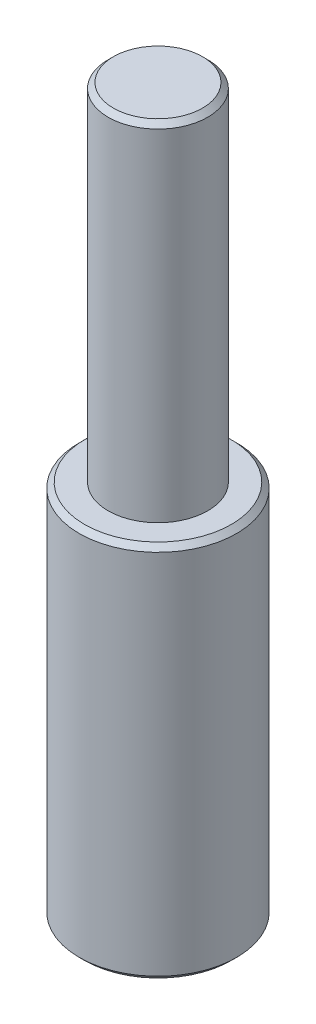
ISO-10303-21;
HEADER;
FILE_DESCRIPTION(('STEP AP214'),'2;1');
FILE_NAME('part.step','',(''),(''),'','','');
FILE_SCHEMA(('AUTOMOTIVE_DESIGN { 1 0 10303 214 1 1 1 1 }'));
ENDSEC;
DATA;
#1=APPLICATION_CONTEXT('core data for automotive mechanical design processes');
#2=APPLICATION_PROTOCOL_DEFINITION('international standard','automotive_design',2000,#1);
#3=PRODUCT_CONTEXT('',#1,'mechanical');
#4=PRODUCT('Part','Part','',(#3));
#5=PRODUCT_RELATED_PRODUCT_CATEGORY('part','',(#4));
#6=PRODUCT_DEFINITION_FORMATION('','',#4);
#7=PRODUCT_DEFINITION_CONTEXT('part definition',#1,'design');
#8=PRODUCT_DEFINITION('design','',#6,#7);
#9=PRODUCT_DEFINITION_SHAPE('','',#8);
#10=(LENGTH_UNIT() NAMED_UNIT(*) SI_UNIT(.MILLI.,.METRE.));
#11=(NAMED_UNIT(*) PLANE_ANGLE_UNIT() SI_UNIT($,.RADIAN.));
#12=(NAMED_UNIT(*) SI_UNIT($,.STERADIAN.) SOLID_ANGLE_UNIT());
#13=UNCERTAINTY_MEASURE_WITH_UNIT(LENGTH_MEASURE(1.E-05),#10,'distance_accuracy_value','');
#14=(GEOMETRIC_REPRESENTATION_CONTEXT(3) GLOBAL_UNCERTAINTY_ASSIGNED_CONTEXT((#13)) GLOBAL_UNIT_ASSIGNED_CONTEXT((#10,
#11,#12)) REPRESENTATION_CONTEXT('',''));
#15=CARTESIAN_POINT('',(0.,0.,0.));
#16=DIRECTION('',(0.,0.,1.));
#17=DIRECTION('',(1.,0.,0.));
#18=AXIS2_PLACEMENT_3D('',#15,#16,#17);
#19=CARTESIAN_POINT('',(0.,7.2,0.));
#20=DIRECTION('',(0.,-1.,0.));
#21=DIRECTION('',(0.,0.,-1.));
#22=AXIS2_PLACEMENT_3D('',#19,#20,#21);
#23=CYLINDRICAL_SURFACE('',#22,1.5);
#24=CARTESIAN_POINT('',(0.,0.0999999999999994,0.));
#25=DIRECTION('',(0.,1.,0.));
#26=DIRECTION('',(0.,0.,1.));
#27=AXIS2_PLACEMENT_3D('',#24,#25,#26);
#28=CIRCLE('',#27,1.5);
#29=CARTESIAN_POINT('',(0.,0.0999999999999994,1.5));
#30=VERTEX_POINT('',#29);
#31=EDGE_CURVE('E63',#30,#30,#28,.T.);
#32=ORIENTED_EDGE('',*,*,#31,.T.);
#33=EDGE_LOOP('',(#32));
#34=FACE_BOUND('',#33,.T.);
#35=CARTESIAN_POINT('',(0.,7.1,0.));
#36=DIRECTION('',(0.,1.,0.));
#37=DIRECTION('',(0.,0.,1.));
#38=AXIS2_PLACEMENT_3D('',#35,#36,#37);
#39=CIRCLE('',#38,1.5);
#40=CARTESIAN_POINT('',(0.,7.1,1.5));
#41=VERTEX_POINT('',#40);
#42=EDGE_CURVE('E56',#41,#41,#39,.F.);
#43=ORIENTED_EDGE('',*,*,#42,.T.);
#44=EDGE_LOOP('',(#43));
#45=FACE_BOUND('',#44,.T.);
#46=ADVANCED_FACE('F33',(#34,#45),#23,.T.);
#47=CARTESIAN_POINT('',(0.,7.2,0.));
#48=DIRECTION('',(0.,1.,0.));
#49=DIRECTION('',(0.,0.,1.));
#50=AXIS2_PLACEMENT_3D('',#47,#48,#49);
#51=PLANE('',#50);
#52=CARTESIAN_POINT('',(0.,7.2,0.));
#53=DIRECTION('',(0.,1.,0.));
#54=DIRECTION('',(0.,0.,1.));
#55=AXIS2_PLACEMENT_3D('',#52,#53,#54);
#56=CIRCLE('',#55,1.4);
#57=CARTESIAN_POINT('',(0.,7.2,1.4));
#58=VERTEX_POINT('',#57);
#59=EDGE_CURVE('E69',#58,#58,#56,.T.);
#60=ORIENTED_EDGE('',*,*,#59,.T.);
#61=EDGE_LOOP('',(#60));
#62=FACE_BOUND('',#61,.T.);
#63=CARTESIAN_POINT('',(0.,7.2,0.));
#64=DIRECTION('',(0.,1.,0.));
#65=DIRECTION('',(0.,0.,1.));
#66=AXIS2_PLACEMENT_3D('',#63,#64,#65);
#67=CIRCLE('',#66,0.95);
#68=CARTESIAN_POINT('',(0.,7.2,0.95));
#69=VERTEX_POINT('',#68);
#70=EDGE_CURVE('E52',#69,#69,#67,.T.);
#71=ORIENTED_EDGE('',*,*,#70,.F.);
#72=EDGE_LOOP('',(#71));
#73=FACE_BOUND('',#72,.T.);
#74=ADVANCED_FACE('F86',(#62,#73),#51,.T.);
#75=CARTESIAN_POINT('',(0.,0.,0.));
#76=DIRECTION('',(0.,1.,0.));
#77=DIRECTION('',(0.,0.,1.));
#78=AXIS2_PLACEMENT_3D('',#75,#76,#77);
#79=PLANE('',#78);
#80=CARTESIAN_POINT('',(0.,0.,0.));
#81=DIRECTION('',(0.,-1.,0.));
#82=DIRECTION('',(0.,0.,-1.));
#83=AXIS2_PLACEMENT_3D('',#80,#81,#82);
#84=CIRCLE('',#83,0.79999999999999);
#85=CARTESIAN_POINT('',(0.,0.,-0.79999999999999));
#86=VERTEX_POINT('',#85);
#87=EDGE_CURVE('E53',#86,#86,#84,.T.);
#88=ORIENTED_EDGE('',*,*,#87,.F.);
#89=EDGE_LOOP('',(#88));
#90=FACE_BOUND('',#89,.T.);
#91=CARTESIAN_POINT('',(0.,0.,0.));
#92=DIRECTION('',(0.,1.,0.));
#93=DIRECTION('',(0.,0.,1.));
#94=AXIS2_PLACEMENT_3D('',#91,#92,#93);
#95=CIRCLE('',#94,1.4);
#96=CARTESIAN_POINT('',(0.,0.,1.4));
#97=VERTEX_POINT('',#96);
#98=EDGE_CURVE('E66',#97,#97,#95,.F.);
#99=ORIENTED_EDGE('',*,*,#98,.T.);
#100=EDGE_LOOP('',(#99));
#101=FACE_BOUND('',#100,.T.);
#102=ADVANCED_FACE('F92',(#90,#101),#79,.F.);
#103=CARTESIAN_POINT('',(0.,13.8,0.));
#104=DIRECTION('',(0.,-1.,0.));
#105=DIRECTION('',(0.,0.,-1.));
#106=AXIS2_PLACEMENT_3D('',#103,#104,#105);
#107=CYLINDRICAL_SURFACE('',#106,0.95);
#108=CARTESIAN_POINT('',(0.,13.7,0.));
#109=DIRECTION('',(0.,1.,0.));
#110=DIRECTION('',(0.,0.,1.));
#111=AXIS2_PLACEMENT_3D('',#108,#109,#110);
#112=CIRCLE('',#111,0.95);
#113=CARTESIAN_POINT('',(0.,13.7,0.95));
#114=VERTEX_POINT('',#113);
#115=EDGE_CURVE('E11',#114,#114,#112,.F.);
#116=ORIENTED_EDGE('',*,*,#115,.T.);
#117=EDGE_LOOP('',(#116));
#118=FACE_BOUND('',#117,.T.);
#119=ORIENTED_EDGE('',*,*,#70,.T.);
#120=EDGE_LOOP('',(#119));
#121=FACE_BOUND('',#120,.T.);
#122=ADVANCED_FACE('F103',(#118,#121),#107,.T.);
#123=CARTESIAN_POINT('',(0.,13.8,0.));
#124=DIRECTION('',(0.,1.,0.));
#125=DIRECTION('',(0.,0.,1.));
#126=AXIS2_PLACEMENT_3D('',#123,#124,#125);
#127=PLANE('',#126);
#128=CARTESIAN_POINT('',(0.,13.8,0.));
#129=DIRECTION('',(0.,1.,0.));
#130=DIRECTION('',(0.,0.,1.));
#131=AXIS2_PLACEMENT_3D('',#128,#129,#130);
#132=CIRCLE('',#131,0.849999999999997);
#133=CARTESIAN_POINT('',(0.,13.8,0.849999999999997));
#134=VERTEX_POINT('',#133);
#135=EDGE_CURVE('E40',#134,#134,#132,.T.);
#136=ORIENTED_EDGE('',*,*,#135,.T.);
#137=EDGE_LOOP('',(#136));
#138=FACE_BOUND('',#137,.T.);
#139=ADVANCED_FACE('F74',(#138),#127,.T.);
#140=CARTESIAN_POINT('',(0.,0.0999999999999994,0.));
#141=DIRECTION('',(0.,1.,0.));
#142=DIRECTION('',(0.,0.,1.));
#143=AXIS2_PLACEMENT_3D('',#140,#141,#142);
#144=CONICAL_SURFACE('',#143,1.5,0.785398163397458);
#145=ORIENTED_EDGE('',*,*,#98,.F.);
#146=EDGE_LOOP('',(#145));
#147=FACE_BOUND('',#146,.T.);
#148=ORIENTED_EDGE('',*,*,#31,.F.);
#149=EDGE_LOOP('',(#148));
#150=FACE_BOUND('',#149,.T.);
#151=ADVANCED_FACE('F82',(#147,#150),#144,.T.);
#152=CARTESIAN_POINT('',(0.,7.2,0.));
#153=DIRECTION('',(0.,-1.,0.));
#154=DIRECTION('',(0.,0.,-1.));
#155=AXIS2_PLACEMENT_3D('',#152,#153,#154);
#156=CONICAL_SURFACE('',#155,1.4,0.785398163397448);
#157=ORIENTED_EDGE('',*,*,#42,.F.);
#158=EDGE_LOOP('',(#157));
#159=FACE_BOUND('',#158,.T.);
#160=ORIENTED_EDGE('',*,*,#59,.F.);
#161=EDGE_LOOP('',(#160));
#162=FACE_BOUND('',#161,.T.);
#163=ADVANCED_FACE('F77',(#159,#162),#156,.T.);
#164=CARTESIAN_POINT('',(0.,13.8,0.));
#165=DIRECTION('',(0.,-1.,0.));
#166=DIRECTION('',(0.,0.,-1.));
#167=AXIS2_PLACEMENT_3D('',#164,#165,#166);
#168=CONICAL_SURFACE('',#167,0.849999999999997,0.785398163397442);
#169=ORIENTED_EDGE('',*,*,#115,.F.);
#170=EDGE_LOOP('',(#169));
#171=FACE_BOUND('',#170,.T.);
#172=ORIENTED_EDGE('',*,*,#135,.F.);
#173=EDGE_LOOP('',(#172));
#174=FACE_BOUND('',#173,.T.);
#175=ADVANCED_FACE('F35',(#171,#174),#168,.T.);
#176=CARTESIAN_POINT('',(0.,5.,0.));
#177=DIRECTION('',(0.,-1.,0.));
#178=DIRECTION('',(0.,0.,-1.));
#179=AXIS2_PLACEMENT_3D('',#176,#177,#178);
#180=CONICAL_SURFACE('',#179,0.799999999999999,1.02974425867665);
#181=CARTESIAN_POINT('',(0.,5.48068849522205,0.));
#182=VERTEX_POINT('',#181);
#183=VERTEX_LOOP('',#182);
#184=FACE_BOUND('',#183,.T.);
#185=CARTESIAN_POINT('',(0.,5.,0.));
#186=DIRECTION('',(0.,-1.,0.));
#187=DIRECTION('',(0.,0.,-1.));
#188=AXIS2_PLACEMENT_3D('',#185,#186,#187);
#189=CIRCLE('',#188,0.799999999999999);
#190=CARTESIAN_POINT('',(0.,5.,-0.799999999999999));
#191=VERTEX_POINT('',#190);
#192=EDGE_CURVE('E50',#191,#191,#189,.T.);
#193=ORIENTED_EDGE('',*,*,#192,.T.);
#194=EDGE_LOOP('',(#193));
#195=FACE_BOUND('',#194,.T.);
#196=ADVANCED_FACE('F43',(#184,#195),#180,.F.);
#197=CARTESIAN_POINT('',(0.,0.,0.));
#198=DIRECTION('',(0.,-1.,0.));
#199=DIRECTION('',(0.,0.,-1.));
#200=AXIS2_PLACEMENT_3D('',#197,#198,#199);
#201=CYLINDRICAL_SURFACE('',#200,0.799999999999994);
#202=ORIENTED_EDGE('',*,*,#192,.F.);
#203=EDGE_LOOP('',(#202));
#204=FACE_BOUND('',#203,.T.);
#205=ORIENTED_EDGE('',*,*,#87,.T.);
#206=EDGE_LOOP('',(#205));
#207=FACE_BOUND('',#206,.T.);
#208=ADVANCED_FACE('F46',(#204,#207),#201,.F.);
#209=CLOSED_SHELL('',(#46,#74,#102,#122,#139,#151,#163,#175,#196,#208));
#210=MANIFOLD_SOLID_BREP('B2',#209);
#211=ADVANCED_BREP_SHAPE_REPRESENTATION('',(#18,#210),#14);
#212=SHAPE_DEFINITION_REPRESENTATION(#9,#211);
ENDSEC;
END-ISO-10303-21;
